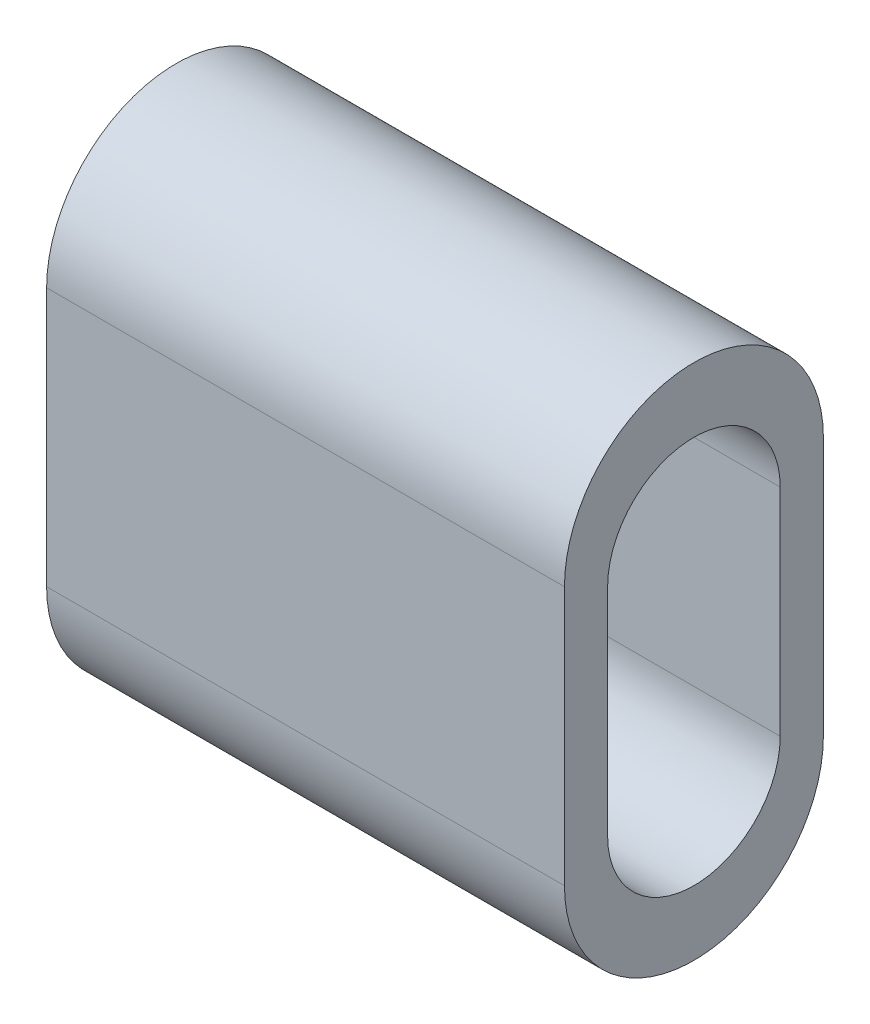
from build123d import *

# Parameters (mm, degrees)
BOSS_EXTRU_1_DEPTH = 12


with BuildPart() as part:
    # Esquisse1 → Boss.-Extru.1 (new body)
    with BuildSketch(Plane(origin=(12, 0, 0), x_dir=(0, 0, -1), z_dir=(1, 0, 0))):
        with BuildLine():
            Line((3, -3), (3, 3))
            ThreePointArc((3, 3), (0, 6), (-3, 3))
            Line((-3, 3), (-3, -3))
            ThreePointArc((-3, -3), (0, -6), (3, -3))
        make_face()
        with BuildLine():
            Line((2, 2.5), (2, -2.5))
            ThreePointArc((2, -2.5), (0, -4.5), (-2, -2.5))
            Line((-2, -2.5), (-2, 2.5))
            ThreePointArc((-2, 2.5), (0, 4.5), (2, 2.5))
        make_face(mode=Mode.SUBTRACT)
    extrude(amount=-BOSS_EXTRU_1_DEPTH)


solid = part.part
